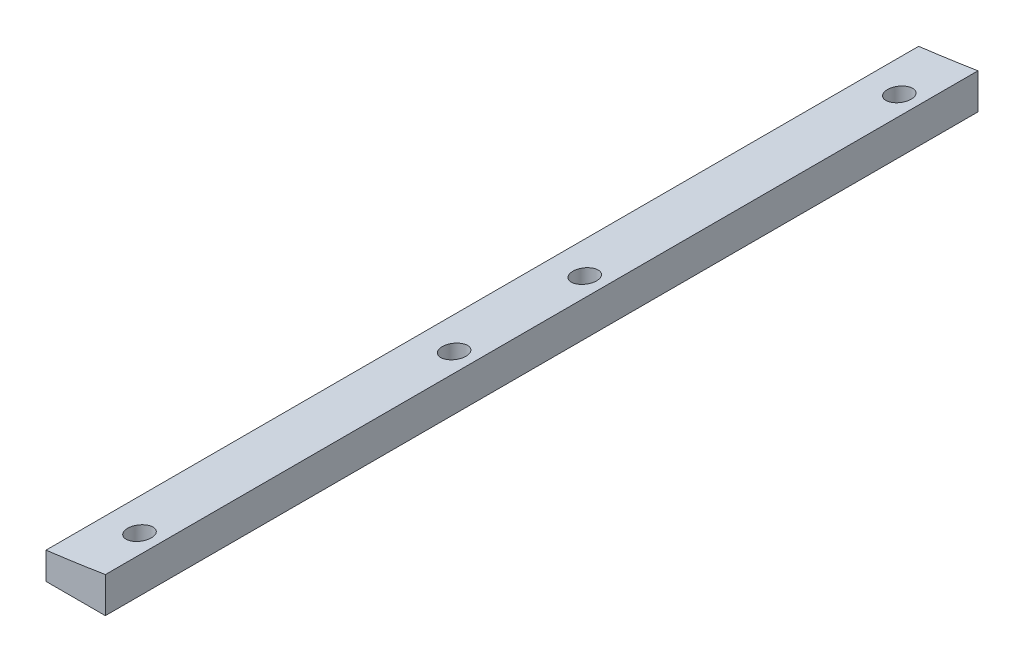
ISO-10303-21;
HEADER;
FILE_DESCRIPTION(('STEP AP214'),'2;1');
FILE_NAME('part.step','',(''),(''),'','','');
FILE_SCHEMA(('AUTOMOTIVE_DESIGN { 1 0 10303 214 1 1 1 1 }'));
ENDSEC;
DATA;
#1=APPLICATION_CONTEXT('core data for automotive mechanical design processes');
#2=APPLICATION_PROTOCOL_DEFINITION('international standard','automotive_design',2000,#1);
#3=PRODUCT_CONTEXT('',#1,'mechanical');
#4=PRODUCT('Part','Part','',(#3));
#5=PRODUCT_RELATED_PRODUCT_CATEGORY('part','',(#4));
#6=PRODUCT_DEFINITION_FORMATION('','',#4);
#7=PRODUCT_DEFINITION_CONTEXT('part definition',#1,'design');
#8=PRODUCT_DEFINITION('design','',#6,#7);
#9=PRODUCT_DEFINITION_SHAPE('','',#8);
#10=(LENGTH_UNIT() NAMED_UNIT(*) SI_UNIT(.MILLI.,.METRE.));
#11=(NAMED_UNIT(*) PLANE_ANGLE_UNIT() SI_UNIT($,.RADIAN.));
#12=(NAMED_UNIT(*) SI_UNIT($,.STERADIAN.) SOLID_ANGLE_UNIT());
#13=UNCERTAINTY_MEASURE_WITH_UNIT(LENGTH_MEASURE(1.E-05),#10,'distance_accuracy_value','');
#14=(GEOMETRIC_REPRESENTATION_CONTEXT(3) GLOBAL_UNCERTAINTY_ASSIGNED_CONTEXT((#13)) GLOBAL_UNIT_ASSIGNED_CONTEXT((#10,
#11,#12)) REPRESENTATION_CONTEXT('',''));
#15=CARTESIAN_POINT('',(0.,0.,0.));
#16=DIRECTION('',(0.,0.,1.));
#17=DIRECTION('',(1.,0.,0.));
#18=AXIS2_PLACEMENT_3D('',#15,#16,#17);
#19=CARTESIAN_POINT('',(95.,-2.6009465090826,294.));
#20=DIRECTION('',(-1.,0.,0.));
#21=DIRECTION('',(0.,0.,1.));
#22=AXIS2_PLACEMENT_3D('',#19,#20,#21);
#23=PLANE('',#22);
#24=DIRECTION('',(0.,1.,0.));
#25=VECTOR('',#24,1.);
#26=CARTESIAN_POINT('',(95.,-2.6009465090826,0.));
#27=LINE('',#26,#25);
#28=CARTESIAN_POINT('',(95.,-14.6009465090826,0.));
#29=VERTEX_POINT('',#28);
#30=CARTESIAN_POINT('',(95.0000000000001,-2.6009465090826,0.));
#31=VERTEX_POINT('',#30);
#32=EDGE_CURVE('E100',#29,#31,#27,.T.);
#33=ORIENTED_EDGE('',*,*,#32,.T.);
#34=DIRECTION('',(0.,0.,-1.));
#35=VECTOR('',#34,1.);
#36=CARTESIAN_POINT('',(95.0000000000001,-2.6009465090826,294.));
#37=LINE('',#36,#35);
#38=CARTESIAN_POINT('',(95.0000000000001,-2.6009465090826,294.));
#39=VERTEX_POINT('',#38);
#40=EDGE_CURVE('E11',#39,#31,#37,.T.);
#41=ORIENTED_EDGE('',*,*,#40,.F.);
#42=DIRECTION('',(0.,1.,0.));
#43=VECTOR('',#42,1.);
#44=CARTESIAN_POINT('',(95.,-2.6009465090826,294.));
#45=LINE('',#44,#43);
#46=CARTESIAN_POINT('',(95.,-14.6009465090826,294.));
#47=VERTEX_POINT('',#46);
#48=EDGE_CURVE('E87',#47,#39,#45,.T.);
#49=ORIENTED_EDGE('',*,*,#48,.F.);
#50=DIRECTION('',(0.,0.,-1.));
#51=VECTOR('',#50,1.);
#52=CARTESIAN_POINT('',(95.,-14.6009465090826,294.));
#53=LINE('',#52,#51);
#54=EDGE_CURVE('E96',#47,#29,#53,.T.);
#55=ORIENTED_EDGE('',*,*,#54,.T.);
#56=EDGE_LOOP('',(#33,#41,#49,#55));
#57=FACE_BOUND('',#56,.T.);
#58=ADVANCED_FACE('F31',(#57),#23,.F.);
#59=CARTESIAN_POINT('',(0.,589.830484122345,294.));
#60=DIRECTION('',(0.,0.,-1.));
#61=DIRECTION('',(-1.,0.,0.));
#62=AXIS2_PLACEMENT_3D('',#59,#60,#61);
#63=CYLINDRICAL_SURFACE('',#62,600.);
#64=CARTESIAN_POINT('',(87.5,-3.75501940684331,165.));
#65=CARTESIAN_POINT('',(87.7266389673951,-3.7216105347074,165.000009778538));
#66=CARTESIAN_POINT('',(87.9534232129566,-3.68804658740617,165.019323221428));
#67=CARTESIAN_POINT('',(88.4007384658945,-3.62158701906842,165.096119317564));
#68=CARTESIAN_POINT('',(88.6212615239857,-3.58869226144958,165.153648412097));
#69=CARTESIAN_POINT('',(89.0495437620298,-3.52457453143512,165.30534375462));
#70=CARTESIAN_POINT('',(89.2573064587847,-3.49335109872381,165.399499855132));
#71=CARTESIAN_POINT('',(89.6540683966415,-3.43352820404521,165.621879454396));
#72=CARTESIAN_POINT('',(89.8430726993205,-3.40492803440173,165.750093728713));
#73=CARTESIAN_POINT('',(90.1960552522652,-3.3513627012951,166.036437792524));
#74=CARTESIAN_POINT('',(90.3601409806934,-3.32638194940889,166.194432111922));
#75=CARTESIAN_POINT('',(90.6594079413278,-3.28071517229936,166.536314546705));
#76=CARTESIAN_POINT('',(90.7945895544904,-3.26002909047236,166.720202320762));
#77=CARTESIAN_POINT('',(91.0306661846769,-3.22384052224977,167.106562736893));
#78=CARTESIAN_POINT('',(91.131910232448,-3.20828529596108,167.308817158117));
#79=CARTESIAN_POINT('',(91.2989872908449,-3.1825866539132,167.72777905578));
#80=CARTESIAN_POINT('',(91.3648226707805,-3.17244287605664,167.944485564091));
#81=CARTESIAN_POINT('',(91.458556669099,-3.15799355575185,168.383766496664));
#82=CARTESIAN_POINT('',(91.4868443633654,-3.15362813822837,168.606255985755));
#83=CARTESIAN_POINT('',(91.5058901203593,-3.15068941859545,169.05286944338));
#84=CARTESIAN_POINT('',(91.4966497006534,-3.15211588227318,169.276993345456));
#85=CARTESIAN_POINT('',(91.4410705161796,-3.16068899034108,169.719299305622));
#86=CARTESIAN_POINT('',(91.3949230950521,-3.16780613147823,169.937506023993));
#87=CARTESIAN_POINT('',(91.2671657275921,-3.18748238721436,170.363014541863));
#88=CARTESIAN_POINT('',(91.1855556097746,-3.20004152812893,170.570316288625));
#89=CARTESIAN_POINT('',(90.9890436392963,-3.23022423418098,170.968769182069));
#90=CARTESIAN_POINT('',(90.8740538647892,-3.2478611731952,171.159875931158));
#91=CARTESIAN_POINT('',(90.6142476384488,-3.28761148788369,171.520075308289));
#92=CARTESIAN_POINT('',(90.469429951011,-3.30972504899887,171.689167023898));
#93=CARTESIAN_POINT('',(90.1526939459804,-3.35794935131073,172.002206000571));
#94=CARTESIAN_POINT('',(89.9805415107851,-3.38409456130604,172.145911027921));
#95=CARTESIAN_POINT('',(89.615021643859,-3.43942242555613,172.402432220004));
#96=CARTESIAN_POINT('',(89.4216529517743,-3.46860526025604,172.51524654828));
#97=CARTESIAN_POINT('',(89.016874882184,-3.52947263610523,172.708085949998));
#98=CARTESIAN_POINT('',(88.8052890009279,-3.5611813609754,172.787732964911));
#99=CARTESIAN_POINT('',(88.3719198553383,-3.62587632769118,172.910303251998));
#100=CARTESIAN_POINT('',(88.1501360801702,-3.65886263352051,172.953224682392));
#101=CARTESIAN_POINT('',(87.7007547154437,-3.72543540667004,173.001395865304));
#102=CARTESIAN_POINT('',(87.4731247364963,-3.75902456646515,173.006340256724));
#103=CARTESIAN_POINT('',(87.020221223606,-3.82558928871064,172.977599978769));
#104=CARTESIAN_POINT('',(86.7949477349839,-3.85856483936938,172.943914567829));
#105=CARTESIAN_POINT('',(86.3528081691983,-3.9230358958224,172.838706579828));
#106=CARTESIAN_POINT('',(86.1359557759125,-3.95452900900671,172.767124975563));
#107=CARTESIAN_POINT('',(85.7172820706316,-4.01511225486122,172.588001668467));
#108=CARTESIAN_POINT('',(85.5154604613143,-4.04420243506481,172.480460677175));
#109=CARTESIAN_POINT('',(85.1337522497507,-4.09904138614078,172.233007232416));
#110=CARTESIAN_POINT('',(84.9537568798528,-4.12480677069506,172.093266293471));
#111=CARTESIAN_POINT('',(84.6198026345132,-4.17247673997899,171.78497695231));
#112=CARTESIAN_POINT('',(84.4658425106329,-4.19438150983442,171.616429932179));
#113=CARTESIAN_POINT('',(84.1898880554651,-4.2335545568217,171.256992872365));
#114=CARTESIAN_POINT('',(84.0676081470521,-4.25086429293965,171.066326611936));
#115=CARTESIAN_POINT('',(83.8568233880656,-4.28065409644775,170.666812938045));
#116=CARTESIAN_POINT('',(83.7683166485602,-4.29313443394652,170.457966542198));
#117=CARTESIAN_POINT('',(83.6284373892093,-4.31283986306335,170.030136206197));
#118=CARTESIAN_POINT('',(83.5767234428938,-4.32011327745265,169.811266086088));
#119=CARTESIAN_POINT('',(83.510648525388,-4.32940405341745,169.367851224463));
#120=CARTESIAN_POINT('',(83.4962861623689,-4.3314216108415,169.143306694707));
#121=CARTESIAN_POINT('',(83.505322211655,-4.33015171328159,168.696278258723));
#122=CARTESIAN_POINT('',(83.5285062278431,-4.32689437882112,168.473789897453));
#123=CARTESIAN_POINT('',(83.6115324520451,-4.31521633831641,168.035905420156));
#124=CARTESIAN_POINT('',(83.6713744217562,-4.30679566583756,167.820509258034));
#125=CARTESIAN_POINT('',(83.825939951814,-4.2850078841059,167.402854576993));
#126=CARTESIAN_POINT('',(83.920668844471,-4.27164001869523,167.200598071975));
#127=CARTESIAN_POINT('',(84.1422038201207,-4.24030458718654,166.814898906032));
#128=CARTESIAN_POINT('',(84.2690093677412,-4.22233709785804,166.631455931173));
#129=CARTESIAN_POINT('',(84.5518231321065,-4.1821501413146,166.287413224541));
#130=CARTESIAN_POINT('',(84.7079950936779,-4.15990681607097,166.126950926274));
#131=CARTESIAN_POINT('',(85.0445962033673,-4.11180726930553,165.834448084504));
#132=CARTESIAN_POINT('',(85.2250324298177,-4.08594999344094,165.702415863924));
#133=CARTESIAN_POINT('',(85.6068669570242,-4.03103329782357,165.469191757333));
#134=CARTESIAN_POINT('',(85.8084543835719,-4.00194482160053,165.368316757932));
#135=CARTESIAN_POINT('',(86.2252326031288,-3.94157098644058,165.201946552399));
#136=CARTESIAN_POINT('',(86.4404077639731,-3.9102881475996,165.136411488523));
#137=CARTESIAN_POINT('',(86.7974049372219,-3.85818015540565,165.059649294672));
#138=CARTESIAN_POINT('',(86.9369944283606,-3.83775582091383,165.037305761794));
#139=CARTESIAN_POINT('',(87.2177038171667,-3.79658085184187,165.007478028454));
#140=CARTESIAN_POINT('',(87.3588237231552,-3.77583021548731,164.999993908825));
#141=CARTESIAN_POINT('',(87.5,-3.75501940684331,165.));
#142=B_SPLINE_CURVE_WITH_KNOTS('',3,(#64,#65,#66,#67,#68,#69,#70,#71,#72,#73,#74,#75,#76,#77,
#78,#79,#80,#81,#82,#83,#84,#85,#86,#87,#88,#89,#90,#91,#92,#93,#94,#95,#96,#97,#98,#99,#100,
#101,#102,#103,#104,#105,#106,#107,#108,#109,#110,#111,#112,#113,#114,#115,#116,#117,#118,#119,
#120,#121,#122,#123,#124,#125,#126,#127,#128,#129,#130,#131,#132,#133,#134,#135,#136,#137,#138,
#139,#140,#141),.UNSPECIFIED.,.T.,.F.,(4,2,2,2,2,2,2,2,2,2,2,2,2,2,2,2,2,2,2,2,2,2,2,2,2,2,2,2,
2,2,2,2,2,2,2,2,2,2,4),(0.,0.686745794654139,1.37432768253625,2.06171921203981,2.74892475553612,
3.43307650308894,4.11721923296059,4.79409302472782,5.47092151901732,6.1406803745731,
6.8104121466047,7.4766940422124,8.14297915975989,8.81103544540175,9.47911941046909,
10.153269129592,10.827458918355,11.5091359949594,12.1908472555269,12.8780342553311,
13.5652344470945,14.2535081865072,14.9417683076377,15.6264438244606,16.3110865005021,
16.9893240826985,17.6675237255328,18.3393447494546,19.0111407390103,19.6791141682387,
20.3470832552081,21.0151544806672,21.6832145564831,22.3551165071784,23.0272148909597,
23.7059394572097,24.3838969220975,24.8116772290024,25.239459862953),.UNSPECIFIED.);
#143=CARTESIAN_POINT('',(87.5,-3.75501940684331,165.));
#144=VERTEX_POINT('',#143);
#145=EDGE_CURVE('E34',#144,#144,#142,.T.);
#146=ORIENTED_EDGE('',*,*,#145,.T.);
#147=EDGE_LOOP('',(#146));
#148=FACE_BOUND('',#147,.T.);
#149=CARTESIAN_POINT('',(87.5,-3.75501940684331,15.));
#150=CARTESIAN_POINT('',(87.7266389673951,-3.72161053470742,15.0000097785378));
#151=CARTESIAN_POINT('',(87.9534232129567,-3.68804658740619,15.019323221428));
#152=CARTESIAN_POINT('',(88.4007384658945,-3.62158701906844,15.096119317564));
#153=CARTESIAN_POINT('',(88.6212615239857,-3.58869226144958,15.1536484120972));
#154=CARTESIAN_POINT('',(89.0495437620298,-3.52457453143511,15.3053437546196));
#155=CARTESIAN_POINT('',(89.2573064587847,-3.4933510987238,15.3994998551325));
#156=CARTESIAN_POINT('',(89.6540683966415,-3.43352820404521,15.6218794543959));
#157=CARTESIAN_POINT('',(89.8430726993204,-3.40492803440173,15.7500937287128));
#158=CARTESIAN_POINT('',(90.1960552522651,-3.3513627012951,16.0364377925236));
#159=CARTESIAN_POINT('',(90.3601409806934,-3.3263819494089,16.1944321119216));
#160=CARTESIAN_POINT('',(90.6594079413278,-3.28071517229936,16.5363145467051));
#161=CARTESIAN_POINT('',(90.7945895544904,-3.26002909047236,16.7202023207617));
#162=CARTESIAN_POINT('',(91.0306661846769,-3.22384052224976,17.1065627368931));
#163=CARTESIAN_POINT('',(91.131910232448,-3.20828529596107,17.3088171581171));
#164=CARTESIAN_POINT('',(91.2989872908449,-3.18258665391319,17.7277790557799));
#165=CARTESIAN_POINT('',(91.3648226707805,-3.17244287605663,17.9444855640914));
#166=CARTESIAN_POINT('',(91.458556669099,-3.15799355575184,18.3837664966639));
#167=CARTESIAN_POINT('',(91.4868443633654,-3.15362813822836,18.6062559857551));
#168=CARTESIAN_POINT('',(91.5058901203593,-3.15068941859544,19.0528694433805));
#169=CARTESIAN_POINT('',(91.4966497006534,-3.15211588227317,19.2769933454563));
#170=CARTESIAN_POINT('',(91.4410705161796,-3.16068899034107,19.719299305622));
#171=CARTESIAN_POINT('',(91.3949230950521,-3.16780613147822,19.937506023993));
#172=CARTESIAN_POINT('',(91.2671657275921,-3.18748238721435,20.3630145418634));
#173=CARTESIAN_POINT('',(91.1855556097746,-3.20004152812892,20.5703162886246));
#174=CARTESIAN_POINT('',(90.9890436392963,-3.23022423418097,20.9687691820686));
#175=CARTESIAN_POINT('',(90.8740538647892,-3.24786117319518,21.1598759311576));
#176=CARTESIAN_POINT('',(90.6142476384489,-3.28761148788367,21.5200753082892));
#177=CARTESIAN_POINT('',(90.469429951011,-3.30972504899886,21.6891670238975));
#178=CARTESIAN_POINT('',(90.1526939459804,-3.35794935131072,22.0022060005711));
#179=CARTESIAN_POINT('',(89.9805415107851,-3.38409456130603,22.1459110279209));
#180=CARTESIAN_POINT('',(89.615021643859,-3.43942242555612,22.4024322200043));
#181=CARTESIAN_POINT('',(89.4216529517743,-3.46860526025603,22.5152465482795));
#182=CARTESIAN_POINT('',(89.016874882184,-3.52947263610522,22.7080859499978));
#183=CARTESIAN_POINT('',(88.8052890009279,-3.56118136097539,22.7877329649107));
#184=CARTESIAN_POINT('',(88.3719198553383,-3.62587632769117,22.9103032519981));
#185=CARTESIAN_POINT('',(88.1501360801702,-3.6588626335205,22.9532246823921));
#186=CARTESIAN_POINT('',(87.7007547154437,-3.72543540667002,23.0013958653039));
#187=CARTESIAN_POINT('',(87.4731247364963,-3.75902456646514,23.0063402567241));
#188=CARTESIAN_POINT('',(87.0202212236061,-3.82558928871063,22.9775999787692));
#189=CARTESIAN_POINT('',(86.7949477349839,-3.85856483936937,22.9439145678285));
#190=CARTESIAN_POINT('',(86.3528081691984,-3.92303589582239,22.8387065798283));
#191=CARTESIAN_POINT('',(86.1359557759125,-3.9545290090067,22.7671249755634));
#192=CARTESIAN_POINT('',(85.7172820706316,-4.01511225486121,22.5880016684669));
#193=CARTESIAN_POINT('',(85.5154604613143,-4.0442024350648,22.4804606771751));
#194=CARTESIAN_POINT('',(85.1337522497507,-4.09904138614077,22.2330072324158));
#195=CARTESIAN_POINT('',(84.9537568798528,-4.12480677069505,22.093266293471));
#196=CARTESIAN_POINT('',(84.6198026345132,-4.17247673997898,21.7849769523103));
#197=CARTESIAN_POINT('',(84.4658425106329,-4.19438150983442,21.6164299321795));
#198=CARTESIAN_POINT('',(84.1898880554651,-4.2335545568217,21.2569928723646));
#199=CARTESIAN_POINT('',(84.0676081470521,-4.25086429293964,21.0663266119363));
#200=CARTESIAN_POINT('',(83.8568233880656,-4.28065409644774,20.6668129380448));
#201=CARTESIAN_POINT('',(83.7683166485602,-4.29313443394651,20.4579665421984));
#202=CARTESIAN_POINT('',(83.6284373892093,-4.31283986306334,20.0301362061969));
#203=CARTESIAN_POINT('',(83.5767234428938,-4.32011327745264,19.8112660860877));
#204=CARTESIAN_POINT('',(83.510648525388,-4.32940405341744,19.3678512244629));
#205=CARTESIAN_POINT('',(83.4962861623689,-4.33142161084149,19.1433066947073));
#206=CARTESIAN_POINT('',(83.505322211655,-4.33015171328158,18.6962782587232));
#207=CARTESIAN_POINT('',(83.5285062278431,-4.32689437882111,18.4737898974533));
#208=CARTESIAN_POINT('',(83.6115324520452,-4.3152163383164,18.035905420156));
#209=CARTESIAN_POINT('',(83.6713744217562,-4.30679566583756,17.8205092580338));
#210=CARTESIAN_POINT('',(83.825939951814,-4.28500788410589,17.4028545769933));
#211=CARTESIAN_POINT('',(83.920668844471,-4.27164001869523,17.2005980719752));
#212=CARTESIAN_POINT('',(84.1422038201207,-4.24030458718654,16.8148989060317));
#213=CARTESIAN_POINT('',(84.2690093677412,-4.22233709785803,16.6314559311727));
#214=CARTESIAN_POINT('',(84.5518231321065,-4.1821501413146,16.2874132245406));
#215=CARTESIAN_POINT('',(84.7079950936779,-4.15990681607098,16.1269509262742));
#216=CARTESIAN_POINT('',(85.0445962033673,-4.11180726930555,15.8344480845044));
#217=CARTESIAN_POINT('',(85.2250324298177,-4.08594999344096,15.7024158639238));
#218=CARTESIAN_POINT('',(85.6068669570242,-4.03103329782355,15.4691917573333));
#219=CARTESIAN_POINT('',(85.8084543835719,-4.00194482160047,15.3683167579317));
#220=CARTESIAN_POINT('',(86.2252326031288,-3.94157098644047,15.201946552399));
#221=CARTESIAN_POINT('',(86.4404077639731,-3.91028814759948,15.1364114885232));
#222=CARTESIAN_POINT('',(86.7974049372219,-3.85818015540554,15.059649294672));
#223=CARTESIAN_POINT('',(86.9369944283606,-3.83775582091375,15.037305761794));
#224=CARTESIAN_POINT('',(87.2177038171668,-3.79658085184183,15.0074780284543));
#225=CARTESIAN_POINT('',(87.3588237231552,-3.77583021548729,14.9999939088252));
#226=CARTESIAN_POINT('',(87.5,-3.75501940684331,15.));
#227=B_SPLINE_CURVE_WITH_KNOTS('',3,(#149,#150,#151,#152,#153,#154,#155,#156,#157,#158,#159,
#160,#161,#162,#163,#164,#165,#166,#167,#168,#169,#170,#171,#172,#173,#174,#175,#176,#177,#178,
#179,#180,#181,#182,#183,#184,#185,#186,#187,#188,#189,#190,#191,#192,#193,#194,#195,#196,#197,
#198,#199,#200,#201,#202,#203,#204,#205,#206,#207,#208,#209,#210,#211,#212,#213,#214,#215,#216,
#217,#218,#219,#220,#221,#222,#223,#224,#225,#226),.UNSPECIFIED.,.T.,.F.,(4,2,2,2,2,2,2,2,2,2,2,
2,2,2,2,2,2,2,2,2,2,2,2,2,2,2,2,2,2,2,2,2,2,2,2,2,2,2,4),(0.,0.686745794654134,1.37432768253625,
2.06171921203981,2.74892475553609,3.43307650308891,4.11721923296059,4.79409302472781,
5.4709215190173,6.1406803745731,6.8104121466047,7.47669404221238,8.14297915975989,
8.81103544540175,9.4791194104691,10.153269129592,10.827458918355,11.5091359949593,
12.1908472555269,12.8780342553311,13.5652344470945,14.2535081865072,14.9417683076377,
15.6264438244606,16.3110865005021,16.9893240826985,17.6675237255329,18.3393447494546,
19.0111407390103,19.6791141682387,20.3470832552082,21.0151544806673,21.6832145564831,
22.3551165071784,23.0272148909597,23.7059394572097,24.3838969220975,24.8116772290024,
25.239459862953),.UNSPECIFIED.);
#228=CARTESIAN_POINT('',(87.5,-3.75501940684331,15.));
#229=VERTEX_POINT('',#228);
#230=EDGE_CURVE('E154',#229,#229,#227,.T.);
#231=ORIENTED_EDGE('',*,*,#230,.T.);
#232=EDGE_LOOP('',(#231));
#233=FACE_BOUND('',#232,.T.);
#234=CARTESIAN_POINT('',(87.5,-3.75501940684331,271.));
#235=CARTESIAN_POINT('',(87.7266389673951,-3.72161053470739,271.000009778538));
#236=CARTESIAN_POINT('',(87.9534232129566,-3.68804658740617,271.019323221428));
#237=CARTESIAN_POINT('',(88.4007384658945,-3.62158701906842,271.096119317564));
#238=CARTESIAN_POINT('',(88.6212615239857,-3.58869226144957,271.153648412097));
#239=CARTESIAN_POINT('',(89.0495437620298,-3.52457453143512,271.30534375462));
#240=CARTESIAN_POINT('',(89.2573064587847,-3.49335109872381,271.399499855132));
#241=CARTESIAN_POINT('',(89.6540683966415,-3.43352820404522,271.621879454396));
#242=CARTESIAN_POINT('',(89.8430726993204,-3.40492803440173,271.750093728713));
#243=CARTESIAN_POINT('',(90.1960552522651,-3.3513627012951,272.036437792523));
#244=CARTESIAN_POINT('',(90.3601409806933,-3.3263819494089,272.194432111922));
#245=CARTESIAN_POINT('',(90.6594079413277,-3.28071517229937,272.536314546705));
#246=CARTESIAN_POINT('',(90.7945895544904,-3.26002909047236,272.720202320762));
#247=CARTESIAN_POINT('',(91.0306661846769,-3.22384052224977,273.106562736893));
#248=CARTESIAN_POINT('',(91.131910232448,-3.20828529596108,273.308817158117));
#249=CARTESIAN_POINT('',(91.2989872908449,-3.18258665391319,273.72777905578));
#250=CARTESIAN_POINT('',(91.3648226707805,-3.17244287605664,273.944485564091));
#251=CARTESIAN_POINT('',(91.458556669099,-3.15799355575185,274.383766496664));
#252=CARTESIAN_POINT('',(91.4868443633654,-3.15362813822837,274.606255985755));
#253=CARTESIAN_POINT('',(91.5058901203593,-3.15068941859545,275.05286944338));
#254=CARTESIAN_POINT('',(91.4966497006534,-3.15211588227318,275.276993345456));
#255=CARTESIAN_POINT('',(91.4410705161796,-3.16068899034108,275.719299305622));
#256=CARTESIAN_POINT('',(91.3949230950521,-3.16780613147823,275.937506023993));
#257=CARTESIAN_POINT('',(91.2671657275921,-3.18748238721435,276.363014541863));
#258=CARTESIAN_POINT('',(91.1855556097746,-3.20004152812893,276.570316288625));
#259=CARTESIAN_POINT('',(90.9890436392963,-3.23022423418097,276.968769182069));
#260=CARTESIAN_POINT('',(90.8740538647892,-3.24786117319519,277.159875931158));
#261=CARTESIAN_POINT('',(90.6142476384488,-3.28761148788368,277.520075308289));
#262=CARTESIAN_POINT('',(90.469429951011,-3.30972504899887,277.689167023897));
#263=CARTESIAN_POINT('',(90.1526939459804,-3.35794935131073,278.002206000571));
#264=CARTESIAN_POINT('',(89.9805415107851,-3.38409456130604,278.145911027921));
#265=CARTESIAN_POINT('',(89.615021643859,-3.43942242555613,278.402432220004));
#266=CARTESIAN_POINT('',(89.4216529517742,-3.46860526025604,278.515246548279));
#267=CARTESIAN_POINT('',(89.0168748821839,-3.52947263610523,278.708085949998));
#268=CARTESIAN_POINT('',(88.8052890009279,-3.5611813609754,278.787732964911));
#269=CARTESIAN_POINT('',(88.3719198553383,-3.62587632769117,278.910303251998));
#270=CARTESIAN_POINT('',(88.1501360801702,-3.6588626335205,278.953224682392));
#271=CARTESIAN_POINT('',(87.7007547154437,-3.72543540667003,279.001395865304));
#272=CARTESIAN_POINT('',(87.4731247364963,-3.75902456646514,279.006340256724));
#273=CARTESIAN_POINT('',(87.020221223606,-3.82558928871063,278.977599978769));
#274=CARTESIAN_POINT('',(86.7949477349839,-3.85856483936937,278.943914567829));
#275=CARTESIAN_POINT('',(86.3528081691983,-3.9230358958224,278.838706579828));
#276=CARTESIAN_POINT('',(86.1359557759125,-3.9545290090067,278.767124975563));
#277=CARTESIAN_POINT('',(85.7172820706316,-4.01511225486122,278.588001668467));
#278=CARTESIAN_POINT('',(85.5154604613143,-4.0442024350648,278.480460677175));
#279=CARTESIAN_POINT('',(85.1337522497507,-4.09904138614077,278.233007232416));
#280=CARTESIAN_POINT('',(84.9537568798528,-4.12480677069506,278.093266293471));
#281=CARTESIAN_POINT('',(84.6198026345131,-4.17247673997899,277.78497695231));
#282=CARTESIAN_POINT('',(84.4658425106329,-4.19438150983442,277.616429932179));
#283=CARTESIAN_POINT('',(84.189888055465,-4.2335545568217,277.256992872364));
#284=CARTESIAN_POINT('',(84.0676081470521,-4.25086429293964,277.066326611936));
#285=CARTESIAN_POINT('',(83.8568233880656,-4.28065409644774,276.666812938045));
#286=CARTESIAN_POINT('',(83.7683166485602,-4.29313443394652,276.457966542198));
#287=CARTESIAN_POINT('',(83.6284373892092,-4.31283986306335,276.030136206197));
#288=CARTESIAN_POINT('',(83.5767234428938,-4.32011327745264,275.811266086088));
#289=CARTESIAN_POINT('',(83.5106485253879,-4.32940405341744,275.367851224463));
#290=CARTESIAN_POINT('',(83.4962861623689,-4.33142161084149,275.143306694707));
#291=CARTESIAN_POINT('',(83.505322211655,-4.33015171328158,274.696278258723));
#292=CARTESIAN_POINT('',(83.5285062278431,-4.32689437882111,274.473789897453));
#293=CARTESIAN_POINT('',(83.6115324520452,-4.3152163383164,274.035905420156));
#294=CARTESIAN_POINT('',(83.6713744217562,-4.30679566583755,273.820509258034));
#295=CARTESIAN_POINT('',(83.825939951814,-4.28500788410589,273.402854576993));
#296=CARTESIAN_POINT('',(83.9206688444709,-4.27164001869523,273.200598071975));
#297=CARTESIAN_POINT('',(84.1422038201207,-4.24030458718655,272.814898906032));
#298=CARTESIAN_POINT('',(84.2690093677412,-4.22233709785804,272.631455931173));
#299=CARTESIAN_POINT('',(84.5518231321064,-4.1821501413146,272.287413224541));
#300=CARTESIAN_POINT('',(84.7079950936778,-4.15990681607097,272.126950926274));
#301=CARTESIAN_POINT('',(85.0445962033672,-4.11180726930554,271.834448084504));
#302=CARTESIAN_POINT('',(85.2250324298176,-4.08594999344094,271.702415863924));
#303=CARTESIAN_POINT('',(85.6068669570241,-4.03103329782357,271.469191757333));
#304=CARTESIAN_POINT('',(85.8084543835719,-4.00194482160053,271.368316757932));
#305=CARTESIAN_POINT('',(86.2252326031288,-3.94157098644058,271.201946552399));
#306=CARTESIAN_POINT('',(86.4404077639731,-3.9102881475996,271.136411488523));
#307=CARTESIAN_POINT('',(86.7974049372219,-3.85818015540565,271.059649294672));
#308=CARTESIAN_POINT('',(86.9369944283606,-3.83775582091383,271.037305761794));
#309=CARTESIAN_POINT('',(87.2177038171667,-3.79658085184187,271.007478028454));
#310=CARTESIAN_POINT('',(87.3588237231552,-3.77583021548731,270.999993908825));
#311=CARTESIAN_POINT('',(87.5,-3.75501940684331,271.));
#312=B_SPLINE_CURVE_WITH_KNOTS('',3,(#234,#235,#236,#237,#238,#239,#240,#241,#242,#243,#244,
#245,#246,#247,#248,#249,#250,#251,#252,#253,#254,#255,#256,#257,#258,#259,#260,#261,#262,#263,
#264,#265,#266,#267,#268,#269,#270,#271,#272,#273,#274,#275,#276,#277,#278,#279,#280,#281,#282,
#283,#284,#285,#286,#287,#288,#289,#290,#291,#292,#293,#294,#295,#296,#297,#298,#299,#300,#301,
#302,#303,#304,#305,#306,#307,#308,#309,#310,#311),.UNSPECIFIED.,.T.,.F.,(4,2,2,2,2,2,2,2,2,2,2,
2,2,2,2,2,2,2,2,2,2,2,2,2,2,2,2,2,2,2,2,2,2,2,2,2,2,2,4),(0.,0.686745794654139,1.37432768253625,
2.0617192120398,2.74892475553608,3.4330765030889,4.11721923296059,4.79409302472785,
5.47092151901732,6.14068037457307,6.8104121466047,7.47669404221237,8.14297915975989,
8.81103544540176,9.4791194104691,10.1532691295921,10.827458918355,11.5091359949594,
12.1908472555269,12.8780342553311,13.5652344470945,14.2535081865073,14.9417683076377,
15.6264438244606,16.3110865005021,16.9893240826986,17.6675237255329,18.3393447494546,
19.0111407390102,19.6791141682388,20.3470832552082,21.0151544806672,21.6832145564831,
22.3551165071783,23.0272148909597,23.7059394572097,24.3838969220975,24.8116772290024,
25.239459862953),.UNSPECIFIED.);
#313=CARTESIAN_POINT('',(87.5,-3.75501940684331,271.));
#314=VERTEX_POINT('',#313);
#315=EDGE_CURVE('E115',#314,#314,#312,.T.);
#316=ORIENTED_EDGE('',*,*,#315,.T.);
#317=EDGE_LOOP('',(#316));
#318=FACE_BOUND('',#317,.T.);
#319=CARTESIAN_POINT('',(87.5,-3.75501940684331,121.));
#320=CARTESIAN_POINT('',(87.7266389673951,-3.72161053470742,121.000009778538));
#321=CARTESIAN_POINT('',(87.9534232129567,-3.68804658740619,121.019323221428));
#322=CARTESIAN_POINT('',(88.4007384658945,-3.62158701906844,121.096119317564));
#323=CARTESIAN_POINT('',(88.6212615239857,-3.58869226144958,121.153648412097));
#324=CARTESIAN_POINT('',(89.0495437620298,-3.52457453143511,121.30534375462));
#325=CARTESIAN_POINT('',(89.2573064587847,-3.4933510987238,121.399499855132));
#326=CARTESIAN_POINT('',(89.6540683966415,-3.43352820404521,121.621879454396));
#327=CARTESIAN_POINT('',(89.8430726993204,-3.40492803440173,121.750093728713));
#328=CARTESIAN_POINT('',(90.1960552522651,-3.3513627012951,122.036437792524));
#329=CARTESIAN_POINT('',(90.3601409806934,-3.32638194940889,122.194432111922));
#330=CARTESIAN_POINT('',(90.6594079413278,-3.28071517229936,122.536314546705));
#331=CARTESIAN_POINT('',(90.7945895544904,-3.26002909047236,122.720202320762));
#332=CARTESIAN_POINT('',(91.0306661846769,-3.22384052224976,123.106562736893));
#333=CARTESIAN_POINT('',(91.131910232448,-3.20828529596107,123.308817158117));
#334=CARTESIAN_POINT('',(91.2989872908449,-3.18258665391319,123.72777905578));
#335=CARTESIAN_POINT('',(91.3648226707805,-3.17244287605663,123.944485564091));
#336=CARTESIAN_POINT('',(91.458556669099,-3.15799355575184,124.383766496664));
#337=CARTESIAN_POINT('',(91.4868443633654,-3.15362813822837,124.606255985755));
#338=CARTESIAN_POINT('',(91.5058901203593,-3.15068941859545,125.05286944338));
#339=CARTESIAN_POINT('',(91.4966497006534,-3.15211588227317,125.276993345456));
#340=CARTESIAN_POINT('',(91.4410705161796,-3.16068899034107,125.719299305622));
#341=CARTESIAN_POINT('',(91.3949230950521,-3.16780613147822,125.937506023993));
#342=CARTESIAN_POINT('',(91.2671657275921,-3.18748238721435,126.363014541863));
#343=CARTESIAN_POINT('',(91.1855556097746,-3.20004152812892,126.570316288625));
#344=CARTESIAN_POINT('',(90.9890436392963,-3.23022423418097,126.968769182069));
#345=CARTESIAN_POINT('',(90.8740538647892,-3.24786117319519,127.159875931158));
#346=CARTESIAN_POINT('',(90.6142476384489,-3.28761148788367,127.520075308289));
#347=CARTESIAN_POINT('',(90.469429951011,-3.30972504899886,127.689167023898));
#348=CARTESIAN_POINT('',(90.1526939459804,-3.35794935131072,128.002206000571));
#349=CARTESIAN_POINT('',(89.9805415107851,-3.38409456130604,128.145911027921));
#350=CARTESIAN_POINT('',(89.615021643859,-3.43942242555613,128.402432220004));
#351=CARTESIAN_POINT('',(89.4216529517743,-3.46860526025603,128.51524654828));
#352=CARTESIAN_POINT('',(89.016874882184,-3.52947263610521,128.708085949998));
#353=CARTESIAN_POINT('',(88.8052890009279,-3.56118136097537,128.787732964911));
#354=CARTESIAN_POINT('',(88.3719198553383,-3.62587632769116,128.910303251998));
#355=CARTESIAN_POINT('',(88.1501360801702,-3.65886263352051,128.953224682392));
#356=CARTESIAN_POINT('',(87.7007547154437,-3.72543540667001,129.001395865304));
#357=CARTESIAN_POINT('',(87.4731247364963,-3.75902456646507,129.006340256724));
#358=CARTESIAN_POINT('',(87.0202212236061,-3.82558928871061,128.977599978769));
#359=CARTESIAN_POINT('',(86.794947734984,-3.85856483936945,128.943914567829));
#360=CARTESIAN_POINT('',(86.3528081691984,-3.92303589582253,128.838706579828));
#361=CARTESIAN_POINT('',(86.1359557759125,-3.9545290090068,128.767124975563));
#362=CARTESIAN_POINT('',(85.7172820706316,-4.01511225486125,128.588001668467));
#363=CARTESIAN_POINT('',(85.5154604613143,-4.04420243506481,128.480460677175));
#364=CARTESIAN_POINT('',(85.1337522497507,-4.09904138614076,128.233007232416));
#365=CARTESIAN_POINT('',(84.9537568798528,-4.12480677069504,128.093266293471));
#366=CARTESIAN_POINT('',(84.6198026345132,-4.17247673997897,127.78497695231));
#367=CARTESIAN_POINT('',(84.4658425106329,-4.19438150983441,127.616429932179));
#368=CARTESIAN_POINT('',(84.1898880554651,-4.2335545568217,127.256992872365));
#369=CARTESIAN_POINT('',(84.0676081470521,-4.25086429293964,127.066326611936));
#370=CARTESIAN_POINT('',(83.8568233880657,-4.28065409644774,126.666812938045));
#371=CARTESIAN_POINT('',(83.7683166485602,-4.29313443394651,126.457966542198));
#372=CARTESIAN_POINT('',(83.6284373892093,-4.31283986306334,126.030136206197));
#373=CARTESIAN_POINT('',(83.5767234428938,-4.32011327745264,125.811266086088));
#374=CARTESIAN_POINT('',(83.510648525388,-4.32940405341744,125.367851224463));
#375=CARTESIAN_POINT('',(83.4962861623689,-4.33142161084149,125.143306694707));
#376=CARTESIAN_POINT('',(83.505322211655,-4.33015171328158,124.696278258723));
#377=CARTESIAN_POINT('',(83.5285062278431,-4.32689437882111,124.473789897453));
#378=CARTESIAN_POINT('',(83.6115324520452,-4.3152163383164,124.035905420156));
#379=CARTESIAN_POINT('',(83.6713744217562,-4.30679566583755,123.820509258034));
#380=CARTESIAN_POINT('',(83.825939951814,-4.28500788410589,123.402854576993));
#381=CARTESIAN_POINT('',(83.920668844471,-4.27164001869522,123.200598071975));
#382=CARTESIAN_POINT('',(84.1422038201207,-4.24030458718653,122.814898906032));
#383=CARTESIAN_POINT('',(84.2690093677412,-4.22233709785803,122.631455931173));
#384=CARTESIAN_POINT('',(84.5518231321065,-4.1821501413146,122.287413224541));
#385=CARTESIAN_POINT('',(84.7079950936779,-4.15990681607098,122.126950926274));
#386=CARTESIAN_POINT('',(85.0445962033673,-4.11180726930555,121.834448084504));
#387=CARTESIAN_POINT('',(85.2250324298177,-4.08594999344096,121.702415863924));
#388=CARTESIAN_POINT('',(85.6068669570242,-4.03103329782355,121.469191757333));
#389=CARTESIAN_POINT('',(85.8084543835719,-4.00194482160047,121.368316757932));
#390=CARTESIAN_POINT('',(86.2252326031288,-3.94157098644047,121.201946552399));
#391=CARTESIAN_POINT('',(86.4404077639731,-3.91028814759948,121.136411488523));
#392=CARTESIAN_POINT('',(86.7974049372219,-3.85818015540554,121.059649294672));
#393=CARTESIAN_POINT('',(86.9369944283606,-3.83775582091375,121.037305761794));
#394=CARTESIAN_POINT('',(87.2177038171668,-3.79658085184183,121.007478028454));
#395=CARTESIAN_POINT('',(87.3588237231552,-3.77583021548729,120.999993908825));
#396=CARTESIAN_POINT('',(87.5,-3.75501940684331,121.));
#397=B_SPLINE_CURVE_WITH_KNOTS('',3,(#319,#320,#321,#322,#323,#324,#325,#326,#327,#328,#329,
#330,#331,#332,#333,#334,#335,#336,#337,#338,#339,#340,#341,#342,#343,#344,#345,#346,#347,#348,
#349,#350,#351,#352,#353,#354,#355,#356,#357,#358,#359,#360,#361,#362,#363,#364,#365,#366,#367,
#368,#369,#370,#371,#372,#373,#374,#375,#376,#377,#378,#379,#380,#381,#382,#383,#384,#385,#386,
#387,#388,#389,#390,#391,#392,#393,#394,#395,#396),.UNSPECIFIED.,.T.,.F.,(4,2,2,2,2,2,2,2,2,2,2,
2,2,2,2,2,2,2,2,2,2,2,2,2,2,2,2,2,2,2,2,2,2,2,2,2,2,2,4),(0.,0.686745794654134,1.37432768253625,
2.06171921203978,2.74892475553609,3.43307650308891,4.11721923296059,4.79409302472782,
5.47092151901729,6.1406803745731,6.81041214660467,7.47669404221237,8.14297915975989,
8.81103544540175,9.47911941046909,10.153269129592,10.827458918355,11.5091359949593,
12.1908472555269,12.878034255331,13.5652344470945,14.2535081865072,14.9417683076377,
15.6264438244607,16.3110865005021,16.9893240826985,17.6675237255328,18.3393447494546,
19.0111407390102,19.6791141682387,20.3470832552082,21.0151544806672,21.6832145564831,
22.3551165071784,23.0272148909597,23.7059394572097,24.3838969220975,24.8116772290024,
25.239459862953),.UNSPECIFIED.);
#398=CARTESIAN_POINT('',(87.5,-3.75501940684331,121.));
#399=VERTEX_POINT('',#398);
#400=EDGE_CURVE('E103',#399,#399,#397,.T.);
#401=ORIENTED_EDGE('',*,*,#400,.T.);
#402=EDGE_LOOP('',(#401));
#403=FACE_BOUND('',#402,.T.);
#404=CARTESIAN_POINT('',(0.,589.830484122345,0.));
#405=DIRECTION('',(0.,0.,-1.));
#406=DIRECTION('',(1.,0.,0.));
#407=AXIS2_PLACEMENT_3D('',#404,#405,#406);
#408=CIRCLE('',#407,600.);
#409=CARTESIAN_POINT('',(75.,-5.46356086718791,0.));
#410=VERTEX_POINT('',#409);
#411=EDGE_CURVE('E91',#31,#410,#408,.T.);
#412=ORIENTED_EDGE('',*,*,#411,.T.);
#413=DIRECTION('',(0.,0.,-1.));
#414=VECTOR('',#413,1.);
#415=CARTESIAN_POINT('',(75.,-5.46356086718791,294.));
#416=LINE('',#415,#414);
#417=CARTESIAN_POINT('',(75.,-5.46356086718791,294.));
#418=VERTEX_POINT('',#417);
#419=EDGE_CURVE('E43',#418,#410,#416,.T.);
#420=ORIENTED_EDGE('',*,*,#419,.F.);
#421=CARTESIAN_POINT('',(0.,589.830484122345,294.));
#422=DIRECTION('',(0.,0.,-1.));
#423=DIRECTION('',(1.,0.,0.));
#424=AXIS2_PLACEMENT_3D('',#421,#422,#423);
#425=CIRCLE('',#424,600.);
#426=EDGE_CURVE('E82',#39,#418,#425,.T.);
#427=ORIENTED_EDGE('',*,*,#426,.F.);
#428=ORIENTED_EDGE('',*,*,#40,.T.);
#429=EDGE_LOOP('',(#412,#420,#427,#428));
#430=FACE_BOUND('',#429,.T.);
#431=ADVANCED_FACE('F90',(#148,#233,#318,#403,#430),#63,.F.);
#432=CARTESIAN_POINT('',(75.,-5.46356086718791,294.));
#433=DIRECTION('',(1.,0.,0.));
#434=DIRECTION('',(0.,0.,-1.));
#435=AXIS2_PLACEMENT_3D('',#432,#433,#434);
#436=PLANE('',#435);
#437=DIRECTION('',(0.,-1.,0.));
#438=VECTOR('',#437,1.);
#439=CARTESIAN_POINT('',(75.,-5.46356086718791,0.));
#440=LINE('',#439,#438);
#441=CARTESIAN_POINT('',(75.,-14.600946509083,0.));
#442=VERTEX_POINT('',#441);
#443=EDGE_CURVE('E69',#410,#442,#440,.T.);
#444=ORIENTED_EDGE('',*,*,#443,.T.);
#445=DIRECTION('',(0.,0.,-1.));
#446=VECTOR('',#445,1.);
#447=CARTESIAN_POINT('',(75.,-14.600946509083,294.));
#448=LINE('',#447,#446);
#449=CARTESIAN_POINT('',(75.,-14.600946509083,294.));
#450=VERTEX_POINT('',#449);
#451=EDGE_CURVE('E92',#450,#442,#448,.T.);
#452=ORIENTED_EDGE('',*,*,#451,.F.);
#453=DIRECTION('',(0.,-1.,0.));
#454=VECTOR('',#453,1.);
#455=CARTESIAN_POINT('',(75.,-5.46356086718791,294.));
#456=LINE('',#455,#454);
#457=EDGE_CURVE('E85',#418,#450,#456,.T.);
#458=ORIENTED_EDGE('',*,*,#457,.F.);
#459=ORIENTED_EDGE('',*,*,#419,.T.);
#460=EDGE_LOOP('',(#444,#452,#458,#459));
#461=FACE_BOUND('',#460,.T.);
#462=ADVANCED_FACE('F94',(#461),#436,.F.);
#463=CARTESIAN_POINT('',(75.,-14.600946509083,294.));
#464=DIRECTION('',(0.,1.,0.));
#465=DIRECTION('',(-1.,0.,0.));
#466=AXIS2_PLACEMENT_3D('',#463,#464,#465);
#467=PLANE('',#466);
#468=CARTESIAN_POINT('',(87.5,-14.6009465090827,169.));
#469=DIRECTION('',(0.,-1.,0.));
#470=DIRECTION('',(0.,0.,-1.));
#471=AXIS2_PLACEMENT_3D('',#468,#469,#470);
#472=CIRCLE('',#471,3.99999999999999);
#473=CARTESIAN_POINT('',(87.5,-14.6009465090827,165.));
#474=VERTEX_POINT('',#473);
#475=EDGE_CURVE('E158',#474,#474,#472,.T.);
#476=ORIENTED_EDGE('',*,*,#475,.F.);
#477=EDGE_LOOP('',(#476));
#478=FACE_BOUND('',#477,.T.);
#479=CARTESIAN_POINT('',(87.5,-14.6009465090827,19.));
#480=DIRECTION('',(0.,-1.,0.));
#481=DIRECTION('',(0.,0.,-1.));
#482=AXIS2_PLACEMENT_3D('',#479,#480,#481);
#483=CIRCLE('',#482,3.99999999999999);
#484=CARTESIAN_POINT('',(87.5,-14.6009465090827,15.));
#485=VERTEX_POINT('',#484);
#486=EDGE_CURVE('E155',#485,#485,#483,.T.);
#487=ORIENTED_EDGE('',*,*,#486,.F.);
#488=EDGE_LOOP('',(#487));
#489=FACE_BOUND('',#488,.T.);
#490=CARTESIAN_POINT('',(87.5,-14.6009465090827,275.));
#491=DIRECTION('',(0.,-1.,0.));
#492=DIRECTION('',(0.,0.,-1.));
#493=AXIS2_PLACEMENT_3D('',#490,#491,#492);
#494=CIRCLE('',#493,3.99999999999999);
#495=CARTESIAN_POINT('',(87.5,-14.6009465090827,271.));
#496=VERTEX_POINT('',#495);
#497=EDGE_CURVE('E151',#496,#496,#494,.T.);
#498=ORIENTED_EDGE('',*,*,#497,.F.);
#499=EDGE_LOOP('',(#498));
#500=FACE_BOUND('',#499,.T.);
#501=CARTESIAN_POINT('',(87.5,-14.6009465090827,125.));
#502=DIRECTION('',(0.,-1.,0.));
#503=DIRECTION('',(0.,0.,-1.));
#504=AXIS2_PLACEMENT_3D('',#501,#502,#503);
#505=CIRCLE('',#504,3.99999999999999);
#506=CARTESIAN_POINT('',(87.5,-14.6009465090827,121.));
#507=VERTEX_POINT('',#506);
#508=EDGE_CURVE('E114',#507,#507,#505,.T.);
#509=ORIENTED_EDGE('',*,*,#508,.F.);
#510=EDGE_LOOP('',(#509));
#511=FACE_BOUND('',#510,.T.);
#512=DIRECTION('',(1.,0.,0.));
#513=VECTOR('',#512,1.);
#514=CARTESIAN_POINT('',(75.,-14.600946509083,0.));
#515=LINE('',#514,#513);
#516=EDGE_CURVE('E75',#442,#29,#515,.T.);
#517=ORIENTED_EDGE('',*,*,#516,.T.);
#518=ORIENTED_EDGE('',*,*,#54,.F.);
#519=DIRECTION('',(1.,0.,0.));
#520=VECTOR('',#519,1.);
#521=CARTESIAN_POINT('',(75.,-14.600946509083,294.));
#522=LINE('',#521,#520);
#523=EDGE_CURVE('E52',#450,#47,#522,.T.);
#524=ORIENTED_EDGE('',*,*,#523,.F.);
#525=ORIENTED_EDGE('',*,*,#451,.T.);
#526=EDGE_LOOP('',(#517,#518,#524,#525));
#527=FACE_BOUND('',#526,.T.);
#528=ADVANCED_FACE('F132',(#478,#489,#500,#511,#527),#467,.F.);
#529=CARTESIAN_POINT('',(0.,589.830484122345,294.));
#530=DIRECTION('',(0.,0.,1.));
#531=DIRECTION('',(1.,0.,0.));
#532=AXIS2_PLACEMENT_3D('',#529,#530,#531);
#533=PLANE('',#532);
#534=ORIENTED_EDGE('',*,*,#48,.T.);
#535=ORIENTED_EDGE('',*,*,#426,.T.);
#536=ORIENTED_EDGE('',*,*,#457,.T.);
#537=ORIENTED_EDGE('',*,*,#523,.T.);
#538=EDGE_LOOP('',(#534,#535,#536,#537));
#539=FACE_BOUND('',#538,.T.);
#540=ADVANCED_FACE('F83',(#539),#533,.T.);
#541=CARTESIAN_POINT('',(0.,589.830484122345,0.));
#542=DIRECTION('',(0.,0.,1.));
#543=DIRECTION('',(1.,0.,0.));
#544=AXIS2_PLACEMENT_3D('',#541,#542,#543);
#545=PLANE('',#544);
#546=ORIENTED_EDGE('',*,*,#32,.F.);
#547=ORIENTED_EDGE('',*,*,#516,.F.);
#548=ORIENTED_EDGE('',*,*,#443,.F.);
#549=ORIENTED_EDGE('',*,*,#411,.F.);
#550=EDGE_LOOP('',(#546,#547,#548,#549));
#551=FACE_BOUND('',#550,.T.);
#552=ADVANCED_FACE('F126',(#551),#545,.F.);
#553=CARTESIAN_POINT('',(87.5,-14.6009465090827,125.));
#554=DIRECTION('',(0.,-1.,0.));
#555=DIRECTION('',(0.,0.,-1.));
#556=AXIS2_PLACEMENT_3D('',#553,#554,#555);
#557=CYLINDRICAL_SURFACE('',#556,4.);
#558=ORIENTED_EDGE('',*,*,#508,.T.);
#559=EDGE_LOOP('',(#558));
#560=FACE_BOUND('',#559,.T.);
#561=ORIENTED_EDGE('',*,*,#400,.F.);
#562=EDGE_LOOP('',(#561));
#563=FACE_BOUND('',#562,.T.);
#564=ADVANCED_FACE('F121',(#560,#563),#557,.F.);
#565=CARTESIAN_POINT('',(87.5,-14.6009465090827,275.));
#566=DIRECTION('',(0.,-1.,0.));
#567=DIRECTION('',(0.,0.,-1.));
#568=AXIS2_PLACEMENT_3D('',#565,#566,#567);
#569=CYLINDRICAL_SURFACE('',#568,4.);
#570=ORIENTED_EDGE('',*,*,#497,.T.);
#571=EDGE_LOOP('',(#570));
#572=FACE_BOUND('',#571,.T.);
#573=ORIENTED_EDGE('',*,*,#315,.F.);
#574=EDGE_LOOP('',(#573));
#575=FACE_BOUND('',#574,.T.);
#576=ADVANCED_FACE('F125',(#572,#575),#569,.F.);
#577=CARTESIAN_POINT('',(87.5,-14.6009465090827,19.));
#578=DIRECTION('',(0.,-1.,0.));
#579=DIRECTION('',(0.,0.,-1.));
#580=AXIS2_PLACEMENT_3D('',#577,#578,#579);
#581=CYLINDRICAL_SURFACE('',#580,4.);
#582=ORIENTED_EDGE('',*,*,#486,.T.);
#583=EDGE_LOOP('',(#582));
#584=FACE_BOUND('',#583,.T.);
#585=ORIENTED_EDGE('',*,*,#230,.F.);
#586=EDGE_LOOP('',(#585));
#587=FACE_BOUND('',#586,.T.);
#588=ADVANCED_FACE('F168',(#584,#587),#581,.F.);
#589=CARTESIAN_POINT('',(87.5,-14.6009465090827,169.));
#590=DIRECTION('',(0.,-1.,0.));
#591=DIRECTION('',(0.,0.,-1.));
#592=AXIS2_PLACEMENT_3D('',#589,#590,#591);
#593=CYLINDRICAL_SURFACE('',#592,4.);
#594=ORIENTED_EDGE('',*,*,#475,.T.);
#595=EDGE_LOOP('',(#594));
#596=FACE_BOUND('',#595,.T.);
#597=ORIENTED_EDGE('',*,*,#145,.F.);
#598=EDGE_LOOP('',(#597));
#599=FACE_BOUND('',#598,.T.);
#600=ADVANCED_FACE('F166',(#596,#599),#593,.F.);
#601=CLOSED_SHELL('',(#58,#431,#462,#528,#540,#552,#564,#576,#588,#600));
#602=MANIFOLD_SOLID_BREP('B2',#601);
#603=ADVANCED_BREP_SHAPE_REPRESENTATION('',(#18,#602),#14);
#604=SHAPE_DEFINITION_REPRESENTATION(#9,#603);
ENDSEC;
END-ISO-10303-21;
